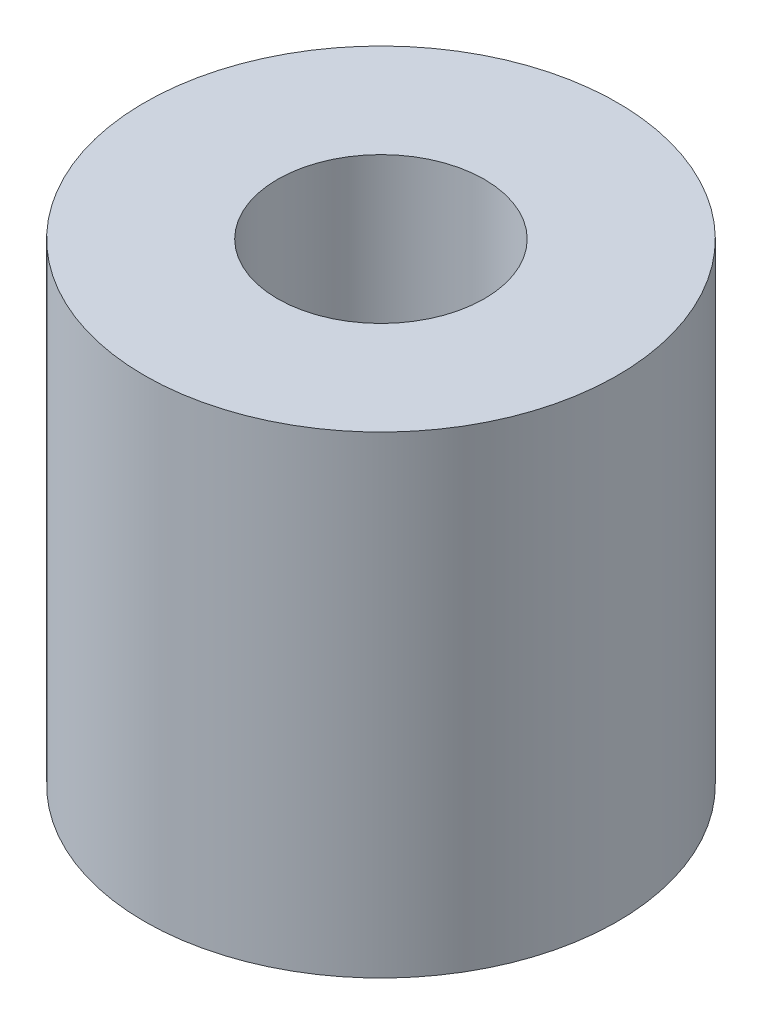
from build123d import *

# Parameters (mm, degrees)
SKETCH1_R           = 4
SKETCH1_R_2         = 1.75
BOSS_EXTRUDE1_DEPTH = 8


with BuildPart() as part:
    # Sketch1 → Boss-Extrude1 (new body)
    with BuildSketch(Plane(origin=(0, 0, 0), x_dir=(1, 0, 0), z_dir=(0, 1, 0))):
        with Locations(Location((0, 0, 0), (0, 0, 270))):
            Circle(SKETCH1_R)
        with Locations(Location((0, 0, 0), (0, 0, 270))):
            Circle(SKETCH1_R_2, mode=Mode.SUBTRACT)
    extrude(amount=BOSS_EXTRUDE1_DEPTH)


solid = part.part
